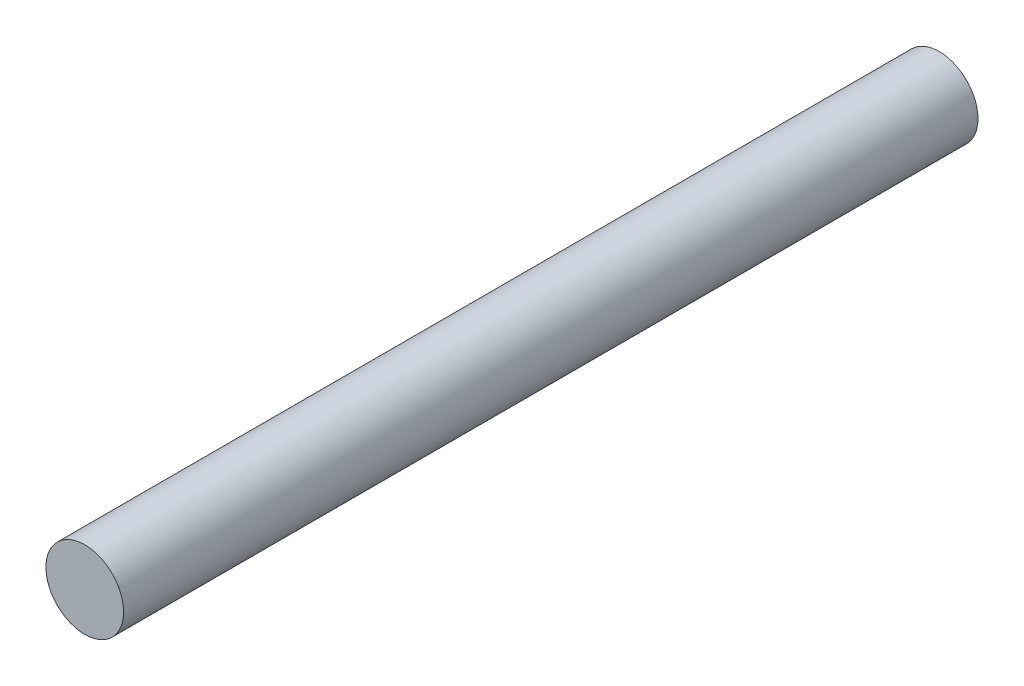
from build123d import *

# Parameters (mm, degrees)
SKETCH1_R           = 1
BOSS_EXTRUDE1_DEPTH = 22


with BuildPart() as part:
    # Sketch1 → Boss-Extrude1 (new body)
    with BuildSketch(Plane.XY):
        Circle(SKETCH1_R)
    extrude(amount=BOSS_EXTRUDE1_DEPTH)


solid = part.part
